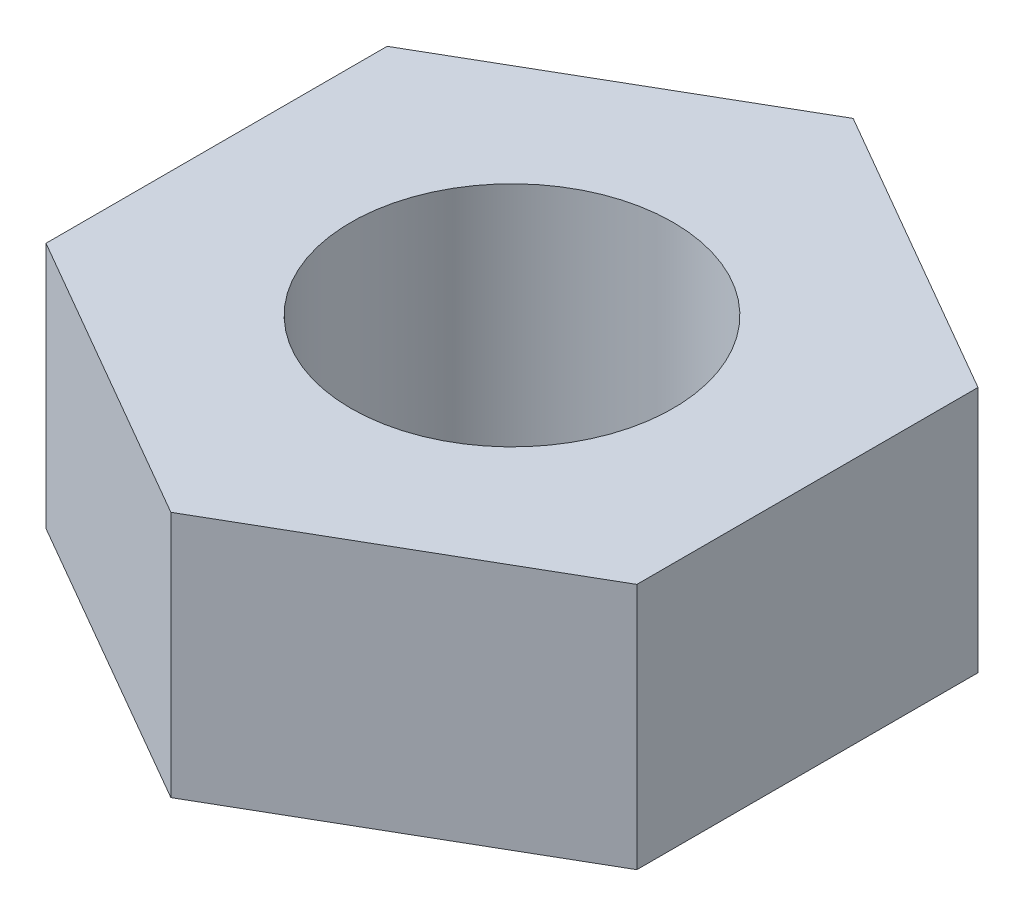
ISO-10303-21;
HEADER;
FILE_DESCRIPTION(('STEP AP214'),'2;1');
FILE_NAME('part.step','',(''),(''),'','','');
FILE_SCHEMA(('AUTOMOTIVE_DESIGN { 1 0 10303 214 1 1 1 1 }'));
ENDSEC;
DATA;
#1=APPLICATION_CONTEXT('core data for automotive mechanical design processes');
#2=APPLICATION_PROTOCOL_DEFINITION('international standard','automotive_design',2000,#1);
#3=PRODUCT_CONTEXT('',#1,'mechanical');
#4=PRODUCT('Part','Part','',(#3));
#5=PRODUCT_RELATED_PRODUCT_CATEGORY('part','',(#4));
#6=PRODUCT_DEFINITION_FORMATION('','',#4);
#7=PRODUCT_DEFINITION_CONTEXT('part definition',#1,'design');
#8=PRODUCT_DEFINITION('design','',#6,#7);
#9=PRODUCT_DEFINITION_SHAPE('','',#8);
#10=(LENGTH_UNIT() NAMED_UNIT(*) SI_UNIT(.MILLI.,.METRE.));
#11=(NAMED_UNIT(*) PLANE_ANGLE_UNIT() SI_UNIT($,.RADIAN.));
#12=(NAMED_UNIT(*) SI_UNIT($,.STERADIAN.) SOLID_ANGLE_UNIT());
#13=UNCERTAINTY_MEASURE_WITH_UNIT(LENGTH_MEASURE(1.E-05),#10,'distance_accuracy_value','');
#14=(GEOMETRIC_REPRESENTATION_CONTEXT(3) GLOBAL_UNCERTAINTY_ASSIGNED_CONTEXT((#13)) GLOBAL_UNIT_ASSIGNED_CONTEXT((#10,
#11,#12)) REPRESENTATION_CONTEXT('',''));
#15=CARTESIAN_POINT('',(0.,0.,0.));
#16=DIRECTION('',(0.,0.,1.));
#17=DIRECTION('',(1.,0.,0.));
#18=AXIS2_PLACEMENT_3D('',#15,#16,#17);
#19=CARTESIAN_POINT('',(0.,2.3,0.));
#20=DIRECTION('',(0.,1.,0.));
#21=DIRECTION('',(0.,0.,1.));
#22=AXIS2_PLACEMENT_3D('',#19,#20,#21);
#23=PLANE('',#22);
#24=DIRECTION('',(-0.866025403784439,0.,-0.5));
#25=VECTOR('',#24,1.);
#26=CARTESIAN_POINT('',(2.74999999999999,2.3,-1.58771324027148));
#27=LINE('',#26,#25);
#28=CARTESIAN_POINT('',(2.74999999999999,2.3,-1.58771324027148));
#29=VERTEX_POINT('',#28);
#30=CARTESIAN_POINT('',(0.,2.3,-3.17542648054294));
#31=VERTEX_POINT('',#30);
#32=EDGE_CURVE('E154',#29,#31,#27,.T.);
#33=ORIENTED_EDGE('',*,*,#32,.T.);
#34=DIRECTION('',(-0.866025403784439,0.,0.499999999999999));
#35=VECTOR('',#34,1.);
#36=CARTESIAN_POINT('',(0.,2.3,-3.17542648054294));
#37=LINE('',#36,#35);
#38=CARTESIAN_POINT('',(-2.75,2.3,-1.58771324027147));
#39=VERTEX_POINT('',#38);
#40=EDGE_CURVE('E102',#31,#39,#37,.T.);
#41=ORIENTED_EDGE('',*,*,#40,.T.);
#42=DIRECTION('',(0.,0.,1.));
#43=VECTOR('',#42,1.);
#44=CARTESIAN_POINT('',(-2.75,2.3,-1.58771324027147));
#45=LINE('',#44,#43);
#46=CARTESIAN_POINT('',(-2.75,2.3,1.58771324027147));
#47=VERTEX_POINT('',#46);
#48=EDGE_CURVE('E115',#39,#47,#45,.T.);
#49=ORIENTED_EDGE('',*,*,#48,.T.);
#50=DIRECTION('',(0.866025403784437,0.,0.500000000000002));
#51=VECTOR('',#50,1.);
#52=CARTESIAN_POINT('',(-2.75,2.3,1.58771324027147));
#53=LINE('',#52,#51);
#54=CARTESIAN_POINT('',(0.,2.3,3.17542648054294));
#55=VERTEX_POINT('',#54);
#56=EDGE_CURVE('E109',#47,#55,#53,.T.);
#57=ORIENTED_EDGE('',*,*,#56,.T.);
#58=DIRECTION('',(0.866025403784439,0.,-0.5));
#59=VECTOR('',#58,1.);
#60=CARTESIAN_POINT('',(0.,2.3,3.17542648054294));
#61=LINE('',#60,#59);
#62=CARTESIAN_POINT('',(2.74999999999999,2.3,1.58771324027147));
#63=VERTEX_POINT('',#62);
#64=EDGE_CURVE('E113',#55,#63,#61,.T.);
#65=ORIENTED_EDGE('',*,*,#64,.T.);
#66=DIRECTION('',(0.,0.,-1.));
#67=VECTOR('',#66,1.);
#68=CARTESIAN_POINT('',(2.74999999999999,2.3,1.58771324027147));
#69=LINE('',#68,#67);
#70=EDGE_CURVE('E58',#63,#29,#69,.T.);
#71=ORIENTED_EDGE('',*,*,#70,.T.);
#72=EDGE_LOOP('',(#33,#41,#49,#57,#65,#71));
#73=FACE_BOUND('',#72,.T.);
#74=CARTESIAN_POINT('',(0.,2.3,0.));
#75=DIRECTION('',(0.,1.,0.));
#76=DIRECTION('',(0.,0.,1.));
#77=AXIS2_PLACEMENT_3D('',#74,#75,#76);
#78=CIRCLE('',#77,1.5);
#79=CARTESIAN_POINT('',(0.,2.3,1.5));
#80=VERTEX_POINT('',#79);
#81=EDGE_CURVE('E142',#80,#80,#78,.T.);
#82=ORIENTED_EDGE('',*,*,#81,.F.);
#83=EDGE_LOOP('',(#82));
#84=FACE_BOUND('',#83,.T.);
#85=ADVANCED_FACE('F38',(#73,#84),#23,.T.);
#86=CARTESIAN_POINT('',(0.,0.,0.));
#87=DIRECTION('',(0.,1.,0.));
#88=DIRECTION('',(0.,0.,1.));
#89=AXIS2_PLACEMENT_3D('',#86,#87,#88);
#90=PLANE('',#89);
#91=DIRECTION('',(-0.866025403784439,0.,-0.5));
#92=VECTOR('',#91,1.);
#93=CARTESIAN_POINT('',(2.74999999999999,0.,-1.58771324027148));
#94=LINE('',#93,#92);
#95=CARTESIAN_POINT('',(2.74999999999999,0.,-1.58771324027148));
#96=VERTEX_POINT('',#95);
#97=CARTESIAN_POINT('',(0.,0.,-3.17542648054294));
#98=VERTEX_POINT('',#97);
#99=EDGE_CURVE('E138',#96,#98,#94,.T.);
#100=ORIENTED_EDGE('',*,*,#99,.F.);
#101=DIRECTION('',(0.,0.,-1.));
#102=VECTOR('',#101,1.);
#103=CARTESIAN_POINT('',(2.74999999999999,0.,1.58771324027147));
#104=LINE('',#103,#102);
#105=CARTESIAN_POINT('',(2.74999999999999,0.,1.58771324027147));
#106=VERTEX_POINT('',#105);
#107=EDGE_CURVE('E93',#106,#96,#104,.T.);
#108=ORIENTED_EDGE('',*,*,#107,.F.);
#109=DIRECTION('',(0.866025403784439,0.,-0.5));
#110=VECTOR('',#109,1.);
#111=CARTESIAN_POINT('',(0.,0.,3.17542648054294));
#112=LINE('',#111,#110);
#113=CARTESIAN_POINT('',(0.,0.,3.17542648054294));
#114=VERTEX_POINT('',#113);
#115=EDGE_CURVE('E87',#114,#106,#112,.T.);
#116=ORIENTED_EDGE('',*,*,#115,.F.);
#117=DIRECTION('',(0.866025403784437,0.,0.500000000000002));
#118=VECTOR('',#117,1.);
#119=CARTESIAN_POINT('',(-2.75,0.,1.58771324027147));
#120=LINE('',#119,#118);
#121=CARTESIAN_POINT('',(-2.75,0.,1.58771324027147));
#122=VERTEX_POINT('',#121);
#123=EDGE_CURVE('E124',#122,#114,#120,.T.);
#124=ORIENTED_EDGE('',*,*,#123,.F.);
#125=DIRECTION('',(0.,0.,1.));
#126=VECTOR('',#125,1.);
#127=CARTESIAN_POINT('',(-2.75,0.,-1.58771324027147));
#128=LINE('',#127,#126);
#129=CARTESIAN_POINT('',(-2.75,0.,-1.58771324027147));
#130=VERTEX_POINT('',#129);
#131=EDGE_CURVE('E145',#130,#122,#128,.T.);
#132=ORIENTED_EDGE('',*,*,#131,.F.);
#133=DIRECTION('',(-0.866025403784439,0.,0.499999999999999));
#134=VECTOR('',#133,1.);
#135=CARTESIAN_POINT('',(0.,0.,-3.17542648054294));
#136=LINE('',#135,#134);
#137=EDGE_CURVE('E141',#98,#130,#136,.T.);
#138=ORIENTED_EDGE('',*,*,#137,.F.);
#139=EDGE_LOOP('',(#100,#108,#116,#124,#132,#138));
#140=FACE_BOUND('',#139,.T.);
#141=CARTESIAN_POINT('',(0.,0.,0.));
#142=DIRECTION('',(0.,1.,0.));
#143=DIRECTION('',(0.,0.,1.));
#144=AXIS2_PLACEMENT_3D('',#141,#142,#143);
#145=CIRCLE('',#144,1.5);
#146=CARTESIAN_POINT('',(0.,0.,1.5));
#147=VERTEX_POINT('',#146);
#148=EDGE_CURVE('E252',#147,#147,#145,.T.);
#149=ORIENTED_EDGE('',*,*,#148,.T.);
#150=EDGE_LOOP('',(#149));
#151=FACE_BOUND('',#150,.T.);
#152=ADVANCED_FACE('F166',(#140,#151),#90,.F.);
#153=CARTESIAN_POINT('',(2.74999999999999,2.3,-1.58771324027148));
#154=DIRECTION('',(-0.5,0.,0.866025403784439));
#155=DIRECTION('',(0.866025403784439,0.,0.5));
#156=AXIS2_PLACEMENT_3D('',#153,#154,#155);
#157=PLANE('',#156);
#158=ORIENTED_EDGE('',*,*,#99,.T.);
#159=DIRECTION('',(0.,-1.,0.));
#160=VECTOR('',#159,1.);
#161=CARTESIAN_POINT('',(0.,2.3,-3.17542648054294));
#162=LINE('',#161,#160);
#163=EDGE_CURVE('E11',#31,#98,#162,.T.);
#164=ORIENTED_EDGE('',*,*,#163,.F.);
#165=ORIENTED_EDGE('',*,*,#32,.F.);
#166=DIRECTION('',(0.,-1.,0.));
#167=VECTOR('',#166,1.);
#168=CARTESIAN_POINT('',(2.74999999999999,2.3,-1.58771324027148));
#169=LINE('',#168,#167);
#170=EDGE_CURVE('E134',#29,#96,#169,.T.);
#171=ORIENTED_EDGE('',*,*,#170,.T.);
#172=EDGE_LOOP('',(#158,#164,#165,#171));
#173=FACE_BOUND('',#172,.T.);
#174=ADVANCED_FACE('F40',(#173),#157,.F.);
#175=CARTESIAN_POINT('',(0.,2.3,-3.17542648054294));
#176=DIRECTION('',(0.499999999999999,0.,0.866025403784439));
#177=DIRECTION('',(0.866025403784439,0.,-0.499999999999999));
#178=AXIS2_PLACEMENT_3D('',#175,#176,#177);
#179=PLANE('',#178);
#180=ORIENTED_EDGE('',*,*,#137,.T.);
#181=DIRECTION('',(0.,-1.,0.));
#182=VECTOR('',#181,1.);
#183=CARTESIAN_POINT('',(-2.75,2.3,-1.58771324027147));
#184=LINE('',#183,#182);
#185=EDGE_CURVE('E47',#39,#130,#184,.T.);
#186=ORIENTED_EDGE('',*,*,#185,.F.);
#187=ORIENTED_EDGE('',*,*,#40,.F.);
#188=ORIENTED_EDGE('',*,*,#163,.T.);
#189=EDGE_LOOP('',(#180,#186,#187,#188));
#190=FACE_BOUND('',#189,.T.);
#191=ADVANCED_FACE('F191',(#190),#179,.F.);
#192=CARTESIAN_POINT('',(-2.75,2.3,-1.58771324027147));
#193=DIRECTION('',(1.,0.,0.));
#194=DIRECTION('',(0.,0.,-1.));
#195=AXIS2_PLACEMENT_3D('',#192,#193,#194);
#196=PLANE('',#195);
#197=ORIENTED_EDGE('',*,*,#131,.T.);
#198=DIRECTION('',(0.,-1.,0.));
#199=VECTOR('',#198,1.);
#200=CARTESIAN_POINT('',(-2.75,2.3,1.58771324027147));
#201=LINE('',#200,#199);
#202=EDGE_CURVE('E126',#47,#122,#201,.T.);
#203=ORIENTED_EDGE('',*,*,#202,.F.);
#204=ORIENTED_EDGE('',*,*,#48,.F.);
#205=ORIENTED_EDGE('',*,*,#185,.T.);
#206=EDGE_LOOP('',(#197,#203,#204,#205));
#207=FACE_BOUND('',#206,.T.);
#208=ADVANCED_FACE('F163',(#207),#196,.F.);
#209=CARTESIAN_POINT('',(-2.75,2.3,1.58771324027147));
#210=DIRECTION('',(0.500000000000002,0.,-0.866025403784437));
#211=DIRECTION('',(-0.866025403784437,0.,-0.500000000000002));
#212=AXIS2_PLACEMENT_3D('',#209,#210,#211);
#213=PLANE('',#212);
#214=ORIENTED_EDGE('',*,*,#123,.T.);
#215=DIRECTION('',(0.,-1.,0.));
#216=VECTOR('',#215,1.);
#217=CARTESIAN_POINT('',(0.,2.3,3.17542648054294));
#218=LINE('',#217,#216);
#219=EDGE_CURVE('E121',#55,#114,#218,.T.);
#220=ORIENTED_EDGE('',*,*,#219,.F.);
#221=ORIENTED_EDGE('',*,*,#56,.F.);
#222=ORIENTED_EDGE('',*,*,#202,.T.);
#223=EDGE_LOOP('',(#214,#220,#221,#222));
#224=FACE_BOUND('',#223,.T.);
#225=ADVANCED_FACE('F122',(#224),#213,.F.);
#226=CARTESIAN_POINT('',(0.,2.3,3.17542648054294));
#227=DIRECTION('',(-0.5,0.,-0.866025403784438));
#228=DIRECTION('',(-0.866025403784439,0.,0.5));
#229=AXIS2_PLACEMENT_3D('',#226,#227,#228);
#230=PLANE('',#229);
#231=ORIENTED_EDGE('',*,*,#115,.T.);
#232=DIRECTION('',(0.,-1.,0.));
#233=VECTOR('',#232,1.);
#234=CARTESIAN_POINT('',(2.74999999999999,2.3,1.58771324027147));
#235=LINE('',#234,#233);
#236=EDGE_CURVE('E127',#63,#106,#235,.T.);
#237=ORIENTED_EDGE('',*,*,#236,.F.);
#238=ORIENTED_EDGE('',*,*,#64,.F.);
#239=ORIENTED_EDGE('',*,*,#219,.T.);
#240=EDGE_LOOP('',(#231,#237,#238,#239));
#241=FACE_BOUND('',#240,.T.);
#242=ADVANCED_FACE('F129',(#241),#230,.F.);
#243=CARTESIAN_POINT('',(2.74999999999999,2.3,1.58771324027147));
#244=DIRECTION('',(-1.,0.,0.));
#245=DIRECTION('',(0.,0.,1.));
#246=AXIS2_PLACEMENT_3D('',#243,#244,#245);
#247=PLANE('',#246);
#248=ORIENTED_EDGE('',*,*,#107,.T.);
#249=ORIENTED_EDGE('',*,*,#170,.F.);
#250=ORIENTED_EDGE('',*,*,#70,.F.);
#251=ORIENTED_EDGE('',*,*,#236,.T.);
#252=EDGE_LOOP('',(#248,#249,#250,#251));
#253=FACE_BOUND('',#252,.T.);
#254=ADVANCED_FACE('F171',(#253),#247,.F.);
#255=CARTESIAN_POINT('',(0.,2.3,0.));
#256=DIRECTION('',(0.,-1.,0.));
#257=DIRECTION('',(0.,0.,-1.));
#258=AXIS2_PLACEMENT_3D('',#255,#256,#257);
#259=CYLINDRICAL_SURFACE('',#258,1.5);
#260=ORIENTED_EDGE('',*,*,#81,.T.);
#261=EDGE_LOOP('',(#260));
#262=FACE_BOUND('',#261,.T.);
#263=ORIENTED_EDGE('',*,*,#148,.F.);
#264=EDGE_LOOP('',(#263));
#265=FACE_BOUND('',#264,.T.);
#266=ADVANCED_FACE('F173',(#262,#265),#259,.F.);
#267=CLOSED_SHELL('',(#85,#152,#174,#191,#208,#225,#242,#254,#266));
#268=MANIFOLD_SOLID_BREP('B2',#267);
#269=ADVANCED_BREP_SHAPE_REPRESENTATION('',(#18,#268),#14);
#270=SHAPE_DEFINITION_REPRESENTATION(#9,#269);
ENDSEC;
END-ISO-10303-21;
